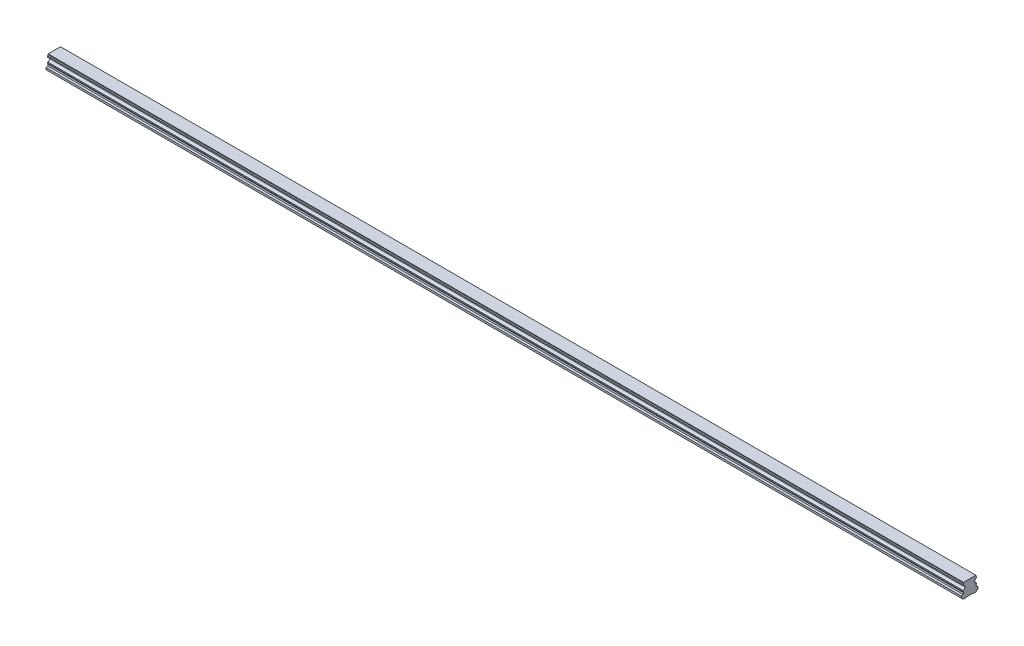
from build123d import *

# Parameters (mm, degrees)
BOSS_EXTRUDE1_DEPTH        = 1380
SKETCH3_R                  = 3
SKETCH3_R_2                = 2.5
CUT_EXTRUDE3_DEPTH         = 12
SKETCH3_2_R                = 2.5
CUT_EXTRUDE4_DEPTH         = 15
CHAMFER1_SIZE              = 0.5
LPATTERN4_COUNT            = 23
LPATTERN4_PITCH            = 60
CHAMFER1_OF_LPATTERN4_SIZE = 0.5


with BuildPart() as part:
    # Sketch1 → Boss-Extrude1 (new body)
    with BuildSketch(Plane(origin=(0, 0, 0), x_dir=(0, 0, -1), z_dir=(1, 0, 0))):
        with BuildLine():
            Line((9.375, 21.8), (-9.375, 21.8))
            Line((-9.375, 21.8), (-9.375, 20.756))
            Line((-9.375, 20.756), (-10, 19.415683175))
            Line((-10, 19.415683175), (-10, 17.685449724))
            ThreePointArc((-10, 17.685449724), (-7.2, 14.6), (-10, 11.514550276))
            Line((-10, 11.514550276), (-10, 9.784316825))
            Line((-10, 9.784316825), (-9.375, 8.444))
            Line((-9.375, 8.444), (-9.922688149, 6.4))
            Line((-9.922688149, 6.4), (-12.5, 5.489338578))
            Line((-12.5, 5.489338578), (-12.5, 2.65))
            Line((-12.5, 2.65), (-9.85, 0))
            Line((-9.85, 0), (-5.5, 0))
            Line((-5.5, 0), (-5, 0.5))
            Line((-5, 0.5), (5, 0.5))
            Line((5, 0.5), (5.5, 0))
            Line((5.5, 0), (9.85, 0))
            Line((9.85, 0), (12.5, 2.65))
            Line((12.5, 2.65), (12.5, 5.489338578))
            Line((12.5, 5.489338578), (9.922688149, 6.4))
            Line((9.922688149, 6.4), (9.375, 8.444))
            Line((9.375, 8.444), (10, 9.784316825))
            Line((10, 9.784316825), (10, 11.514550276))
            ThreePointArc((10, 11.514550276), (7.2, 14.6), (10, 17.685449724))
            Line((10, 17.685449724), (10, 19.415683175))
            Line((10, 19.415683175), (9.375, 20.756))
            Line((9.375, 20.756), (9.375, 21.8))
        make_face()
    extrude(amount=BOSS_EXTRUDE1_DEPTH)

    # Sketch3 → Cut-Extrude3 (cut)
    with BuildSketch(Plane.XZ):
        with Locations(Location((30, 0, 0), (0, 0, 270))):
            Circle(SKETCH3_R)
        with Locations(Location((30, 0, 0), (0, 0, 270))):
            Circle(SKETCH3_R_2, mode=Mode.SUBTRACT)
    cut_extrude3 = extrude(amount=-CUT_EXTRUDE3_DEPTH, mode=Mode.SUBTRACT)

    # Sketch3_2 → Cut-Extrude4 (cut)
    with BuildSketch(Plane.XZ):
        with Locations(Location((30, 0, 0), (0, 0, 270))):
            Circle(SKETCH3_2_R)
    cut_extrude4 = extrude(amount=-CUT_EXTRUDE4_DEPTH, mode=Mode.SUBTRACT)

    # Cut-Extrude5 cone 1 section (on through the dimple's axis) → Cut-Extrude5 (revolve, cut)
    with BuildSketch(Plane(origin=(30, 15, 0), x_dir=(0, 0, -1), z_dir=(1, 0, 0))):
        Polygon((0, 0), (2.5, 0), (0, 1.443375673), align=None)
    cut_extrude5 = revolve(axis=Axis((30, 15, 0), (0, 1, 0)), mode=Mode.SUBTRACT)

    # Chamfer1
    chamfer1_edges = [part.edges().sort_by_distance(p)[0] for p in [
        (30, 0.5, 3),
    ]]
    chamfer(chamfer1_edges, length=CHAMFER1_SIZE)

    # LPattern4: Cut-Extrude3, Cut-Extrude4, Cut-Extrude5 ×23
    with Locations(*[(i * LPATTERN4_PITCH, 0, 0) for i in range(1, LPATTERN4_COUNT)]):
        add(cut_extrude3, mode=Mode.SUBTRACT)
        add(cut_extrude4, mode=Mode.SUBTRACT)
        add(cut_extrude5, mode=Mode.SUBTRACT)

    # Chamfer1 of LPattern4
    chamfer1_of_lpattern4_edges = [part.edges().sort_by_distance(p)[0] for p in [
        (90, 0.5, 3),
        (150, 0.5, 3),
        (210, 0.5, 3),
        (270, 0.5, 3),
        (330, 0.5, 3),
        (390, 0.5, 3),
        (450, 0.5, 3),
        (510, 0.5, 3),
        (570, 0.5, 3),
        (630, 0.5, 3),
        (690, 0.5, 3),
        (750, 0.5, 3),
        (810, 0.5, 3),
        (870, 0.5, 3),
        (930, 0.5, 3),
        (990, 0.5, 3),
        (1050, 0.5, 3),
        (1110, 0.5, 3),
        (1170, 0.5, 3),
        (1230, 0.5, 3),
        (1290, 0.5, 3),
        (1350, 0.5, 3),
    ]]
    chamfer(chamfer1_of_lpattern4_edges, length=CHAMFER1_OF_LPATTERN4_SIZE)


solid = part.part
